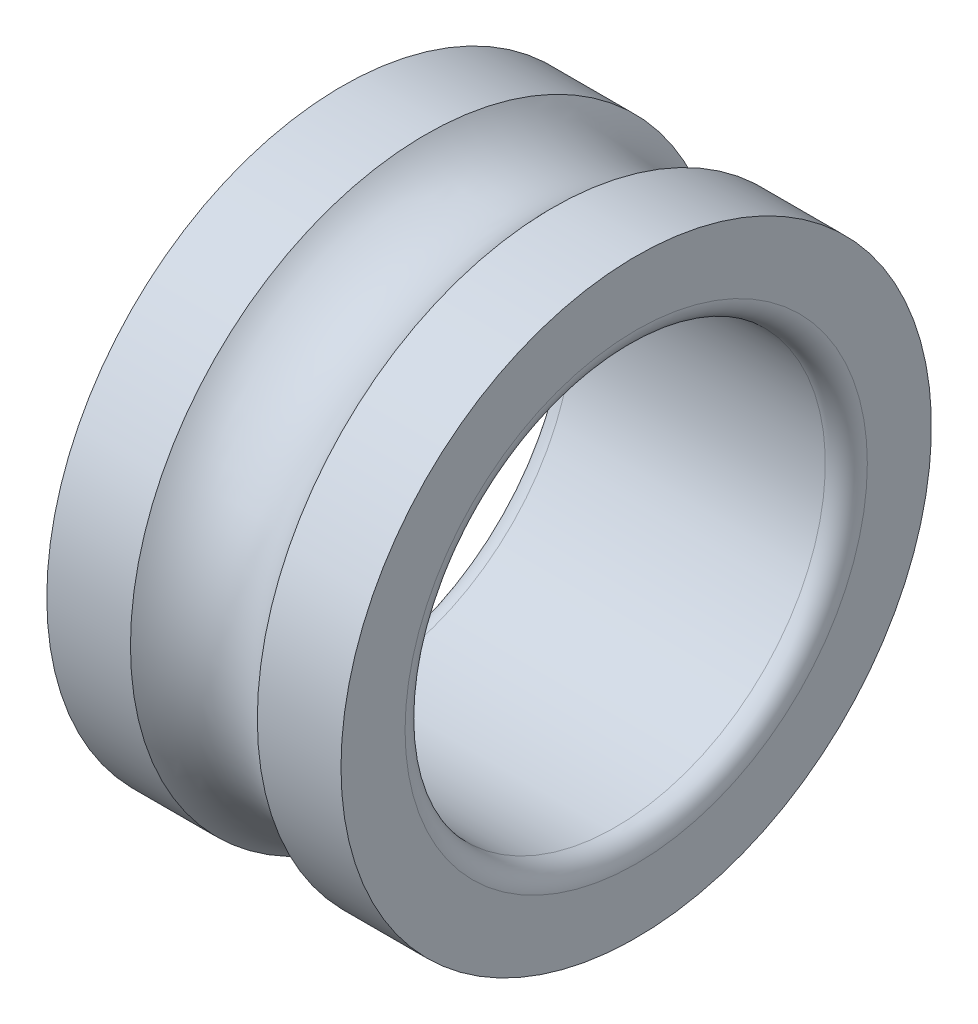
from build123d import *


with BuildPart() as part:
    # Esquisse1 → Base-R_volution (revolve)
    with BuildSketch(Plane(origin=(0, 0, 0), x_dir=(1, 0, 0), z_dir=(0, 1, 0)), mode=Mode.PRIVATE) as base_r_volution_sk:
        with BuildLine():
            Line((0, 14.05), (0, 11))
            ThreePointArc((0, 11), (0.292893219, 10.292893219), (1, 10))
            Line((1, 10), (13, 10))
            ThreePointArc((13, 10), (13.707106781, 10.292893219), (14, 11))
            Line((14, 11), (14, 14.05))
            Line((14, 14.05), (10.01869177, 14.05))
            ThreePointArc((10.01869177, 14.05), (7, 12.7), (3.98130823, 14.05))
            Line((3.98130823, 14.05), (0, 14.05))
        make_face()
    revolve(base_r_volution_sk.sketch.rotate(Axis((0, 0, 0), (1, 0, 0)), 180), axis=Axis((0, 0, 0), (1, 0, 0)))


solid = part.part
